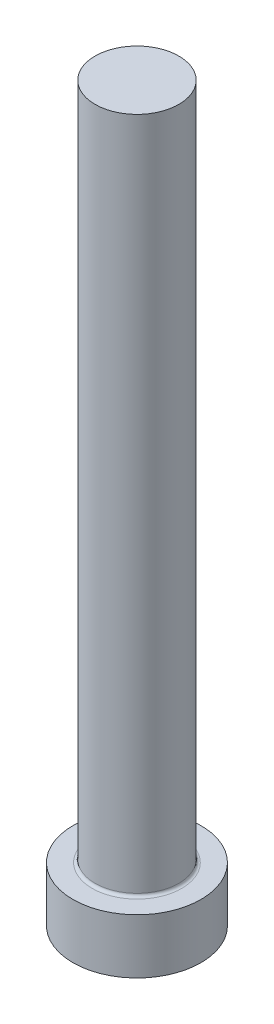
from build123d import *


with BuildPart() as part:
    # Sketch1 → Revolve3 (revolve)
    with BuildSketch(Plane.XY, mode=Mode.PRIVATE) as revolve3_sk:
        with BuildLine():
            Line((0, 0), (5.5499, 0))
            Line((5.5499, 0), (5.5499, 4.7498))
            Line((5.5499, 4.7498), (3.8862, 4.7498))
            ThreePointArc((3.8862, 4.7498), (3.706594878, 4.824194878), (3.6322, 5.0038))
            Line((3.6322, 5.0038), (3.6322, 63.5))
            Line((3.6322, 63.5), (0, 63.5))
            Line((0, 63.5), (0, 0))
        make_face()
    revolve(revolve3_sk.sketch.rotate(Axis((0, 0, 0), (0, -1, 0)), 90), axis=Axis((0, 0, 0), (0, -1, 0)))


solid = part.part
